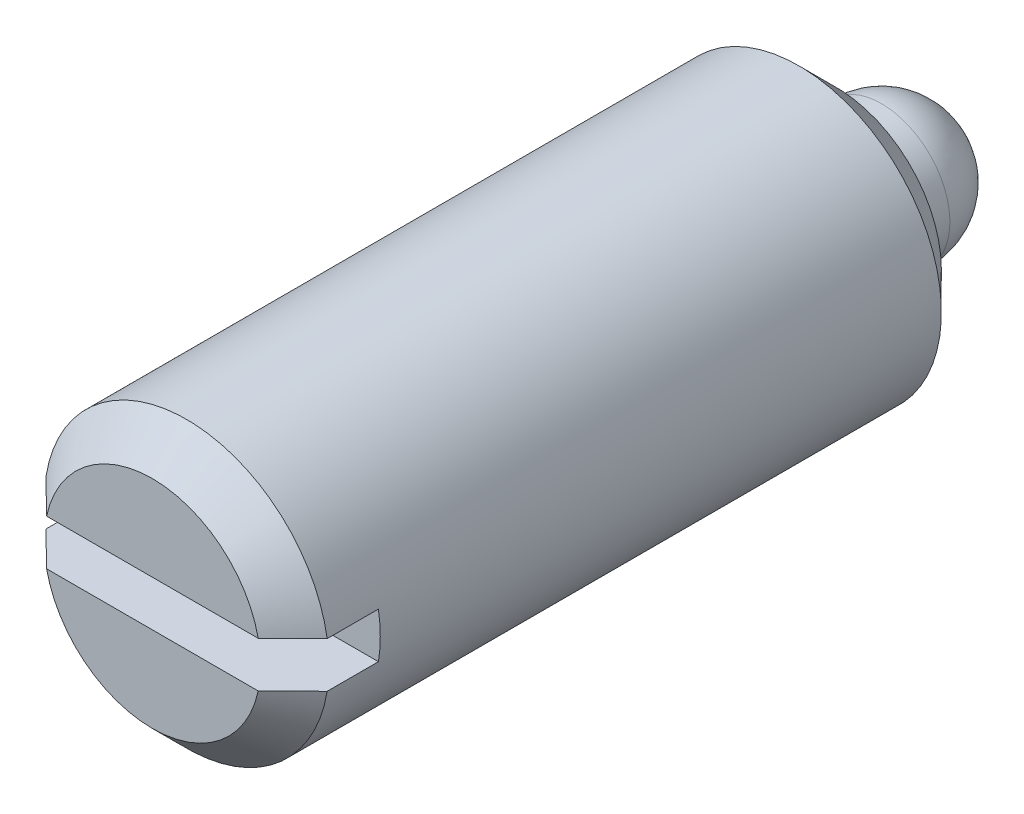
ISO-10303-21;
HEADER;
FILE_DESCRIPTION(('STEP AP214'),'2;1');
FILE_NAME('part.step','',(''),(''),'','','');
FILE_SCHEMA(('AUTOMOTIVE_DESIGN { 1 0 10303 214 1 1 1 1 }'));
ENDSEC;
DATA;
#1=APPLICATION_CONTEXT('core data for automotive mechanical design processes');
#2=APPLICATION_PROTOCOL_DEFINITION('international standard','automotive_design',2000,#1);
#3=PRODUCT_CONTEXT('',#1,'mechanical');
#4=PRODUCT('Part','Part','',(#3));
#5=PRODUCT_RELATED_PRODUCT_CATEGORY('part','',(#4));
#6=PRODUCT_DEFINITION_FORMATION('','',#4);
#7=PRODUCT_DEFINITION_CONTEXT('part definition',#1,'design');
#8=PRODUCT_DEFINITION('design','',#6,#7);
#9=PRODUCT_DEFINITION_SHAPE('','',#8);
#10=(LENGTH_UNIT() NAMED_UNIT(*) SI_UNIT(.MILLI.,.METRE.));
#11=(NAMED_UNIT(*) PLANE_ANGLE_UNIT() SI_UNIT($,.RADIAN.));
#12=(NAMED_UNIT(*) SI_UNIT($,.STERADIAN.) SOLID_ANGLE_UNIT());
#13=UNCERTAINTY_MEASURE_WITH_UNIT(LENGTH_MEASURE(1.E-05),#10,'distance_accuracy_value','');
#14=(GEOMETRIC_REPRESENTATION_CONTEXT(3) GLOBAL_UNCERTAINTY_ASSIGNED_CONTEXT((#13)) GLOBAL_UNIT_ASSIGNED_CONTEXT((#10,
#11,#12)) REPRESENTATION_CONTEXT('',''));
#15=CARTESIAN_POINT('',(0.,0.,0.));
#16=DIRECTION('',(0.,0.,1.));
#17=DIRECTION('',(1.,0.,0.));
#18=AXIS2_PLACEMENT_3D('',#15,#16,#17);
#19=CARTESIAN_POINT('',(0.,0.,1.2));
#20=DIRECTION('',(0.,0.,1.));
#21=DIRECTION('',(0.,-1.,0.));
#22=AXIS2_PLACEMENT_3D('',#19,#20,#21);
#23=SPHERICAL_SURFACE('',#22,1.2);
#24=CARTESIAN_POINT('',(0.,1.2E-08,0.));
#25=VERTEX_POINT('',#24);
#26=VERTEX_LOOP('',#25);
#27=FACE_BOUND('',#26,.T.);
#28=CARTESIAN_POINT('',(0.,0.,1.2));
#29=DIRECTION('',(0.,0.,1.));
#30=DIRECTION('',(-1.,0.,0.));
#31=AXIS2_PLACEMENT_3D('',#28,#29,#30);
#32=CIRCLE('',#31,1.2);
#33=CARTESIAN_POINT('',(-1.2,0.,1.2));
#34=VERTEX_POINT('',#33);
#35=EDGE_CURVE('E110',#34,#34,#32,.T.);
#36=ORIENTED_EDGE('',*,*,#35,.F.);
#37=EDGE_LOOP('',(#36));
#38=FACE_BOUND('',#37,.T.);
#39=ADVANCED_FACE('F14',(#27,#38),#23,.T.);
#40=CARTESIAN_POINT('',(0.,0.,1.2));
#41=DIRECTION('',(0.,0.,1.));
#42=DIRECTION('',(-1.,0.,0.));
#43=AXIS2_PLACEMENT_3D('',#40,#41,#42);
#44=CYLINDRICAL_SURFACE('',#43,1.2);
#45=CARTESIAN_POINT('',(0.,0.,2.));
#46=DIRECTION('',(0.,0.,1.));
#47=DIRECTION('',(-1.,0.,0.));
#48=AXIS2_PLACEMENT_3D('',#45,#46,#47);
#49=CIRCLE('',#48,1.2);
#50=CARTESIAN_POINT('',(-1.2,0.,2.));
#51=VERTEX_POINT('',#50);
#52=EDGE_CURVE('E113',#51,#51,#49,.F.);
#53=ORIENTED_EDGE('',*,*,#52,.T.);
#54=EDGE_LOOP('',(#53));
#55=FACE_BOUND('',#54,.T.);
#56=ORIENTED_EDGE('',*,*,#35,.T.);
#57=EDGE_LOOP('',(#56));
#58=FACE_BOUND('',#57,.T.);
#59=ADVANCED_FACE('F190',(#55,#58),#44,.T.);
#60=CARTESIAN_POINT('',(-1.463031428,1.519055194,14.));
#61=DIRECTION('',(0.,0.,-1.));
#62=DIRECTION('',(1.,0.,0.));
#63=AXIS2_PLACEMENT_3D('',#60,#61,#62);
#64=PLANE('',#63);
#65=DIRECTION('',(1.,0.,0.));
#66=VECTOR('',#65,1.);
#67=CARTESIAN_POINT('',(0.,0.4,14.));
#68=LINE('',#67,#66);
#69=CARTESIAN_POINT('',(-1.85741756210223,0.4,14.));
#70=VERTEX_POINT('',#69);
#71=CARTESIAN_POINT('',(1.85741756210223,0.4,14.));
#72=VERTEX_POINT('',#71);
#73=EDGE_CURVE('E117',#70,#72,#68,.T.);
#74=ORIENTED_EDGE('',*,*,#73,.T.);
#75=CARTESIAN_POINT('',(0.,0.,14.));
#76=DIRECTION('',(0.,0.,-1.));
#77=DIRECTION('',(0.,1.,0.));
#78=AXIS2_PLACEMENT_3D('',#75,#76,#77);
#79=CIRCLE('',#78,1.90000000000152);
#80=EDGE_CURVE('E120',#72,#70,#79,.F.);
#81=ORIENTED_EDGE('',*,*,#80,.T.);
#82=EDGE_LOOP('',(#74,#81));
#83=FACE_BOUND('',#82,.T.);
#84=ADVANCED_FACE('F164',(#83),#64,.F.);
#85=CARTESIAN_POINT('',(1.8722,1.878642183,2.));
#86=DIRECTION('',(0.,0.,1.));
#87=DIRECTION('',(-1.,0.,0.));
#88=AXIS2_PLACEMENT_3D('',#85,#86,#87);
#89=PLANE('',#88);
#90=ORIENTED_EDGE('',*,*,#52,.F.);
#91=EDGE_LOOP('',(#90));
#92=FACE_BOUND('',#91,.T.);
#93=CARTESIAN_POINT('',(0.,0.,2.));
#94=DIRECTION('',(0.,0.,1.));
#95=DIRECTION('',(-1.,0.,0.));
#96=AXIS2_PLACEMENT_3D('',#93,#94,#95);
#97=CIRCLE('',#96,1.85);
#98=CARTESIAN_POINT('',(-1.85,0.,2.));
#99=VERTEX_POINT('',#98);
#100=EDGE_CURVE('E114',#99,#99,#97,.T.);
#101=ORIENTED_EDGE('',*,*,#100,.F.);
#102=EDGE_LOOP('',(#101));
#103=FACE_BOUND('',#102,.T.);
#104=ADVANCED_FACE('F173',(#92,#103),#89,.F.);
#105=CARTESIAN_POINT('',(-1.463031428,-0.4,14.));
#106=DIRECTION('',(0.,0.,-1.));
#107=DIRECTION('',(1.,0.,0.));
#108=AXIS2_PLACEMENT_3D('',#105,#106,#107);
#109=PLANE('',#108);
#110=DIRECTION('',(-1.,0.,0.));
#111=VECTOR('',#110,1.);
#112=CARTESIAN_POINT('',(0.,-0.4,14.));
#113=LINE('',#112,#111);
#114=CARTESIAN_POINT('',(1.8574175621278,-0.4,14.));
#115=VERTEX_POINT('',#114);
#116=CARTESIAN_POINT('',(-1.8574175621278,-0.4,14.));
#117=VERTEX_POINT('',#116);
#118=EDGE_CURVE('E106',#115,#117,#113,.T.);
#119=ORIENTED_EDGE('',*,*,#118,.T.);
#120=CARTESIAN_POINT('',(0.,0.,14.));
#121=DIRECTION('',(0.,0.,-1.));
#122=DIRECTION('',(0.,1.,0.));
#123=AXIS2_PLACEMENT_3D('',#120,#121,#122);
#124=CIRCLE('',#123,1.90000000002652);
#125=EDGE_CURVE('E155',#117,#115,#124,.F.);
#126=ORIENTED_EDGE('',*,*,#125,.T.);
#127=EDGE_LOOP('',(#119,#126));
#128=FACE_BOUND('',#127,.T.);
#129=ADVANCED_FACE('F143',(#128),#109,.F.);
#130=CARTESIAN_POINT('',(-2.467792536,0.4,14.));
#131=DIRECTION('',(0.,1.,0.));
#132=DIRECTION('',(1.,0.,0.));
#133=AXIS2_PLACEMENT_3D('',#130,#131,#132);
#134=PLANE('',#133);
#135=DIRECTION('',(0.,0.,1.));
#136=VECTOR('',#135,1.);
#137=CARTESIAN_POINT('',(-2.46779253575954,0.400000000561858,7.825));
#138=LINE('',#137,#136);
#139=CARTESIAN_POINT('',(-2.46779253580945,0.400000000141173,12.5));
#140=VERTEX_POINT('',#139);
#141=CARTESIAN_POINT('',(-2.46779253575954,0.400000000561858,13.4000000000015));
#142=VERTEX_POINT('',#141);
#143=EDGE_CURVE('E94',#140,#142,#138,.T.);
#144=ORIENTED_EDGE('',*,*,#143,.F.);
#145=DIRECTION('',(-1.,-3.01401580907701E-11,0.));
#146=VECTOR('',#145,1.);
#147=CARTESIAN_POINT('',(2.46779253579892,0.400000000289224,12.5));
#148=LINE('',#147,#146);
#149=CARTESIAN_POINT('',(2.46779253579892,0.400000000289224,12.5));
#150=VERTEX_POINT('',#149);
#151=EDGE_CURVE('E79',#150,#140,#148,.T.);
#152=ORIENTED_EDGE('',*,*,#151,.F.);
#153=DIRECTION('',(0.,0.,-1.));
#154=VECTOR('',#153,1.);
#155=CARTESIAN_POINT('',(2.4677925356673,0.400000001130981,7.825));
#156=LINE('',#155,#154);
#157=CARTESIAN_POINT('',(2.4677925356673,0.400000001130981,13.4000000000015));
#158=VERTEX_POINT('',#157);
#159=EDGE_CURVE('E91',#158,#150,#156,.T.);
#160=ORIENTED_EDGE('',*,*,#159,.F.);
#161=CARTESIAN_POINT('',(2.4677925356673,0.400000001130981,13.4000000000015));
#162=CARTESIAN_POINT('',(2.41703205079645,0.400000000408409,13.4501058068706));
#163=CARTESIAN_POINT('',(2.36625249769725,0.400000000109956,13.5001923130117));
#164=CARTESIAN_POINT('',(2.26464552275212,0.399999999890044,13.6003166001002));
#165=CARTESIAN_POINT('',(2.21381810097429,0.399999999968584,13.6503543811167));
#166=CARTESIAN_POINT('',(2.11210548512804,0.400000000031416,13.7503712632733));
#167=CARTESIAN_POINT('',(2.0612202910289,0.400000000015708,13.8003503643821));
#168=CARTESIAN_POINT('',(1.95937717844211,0.399999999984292,13.9002345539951));
#169=CARTESIAN_POINT('',(1.90841925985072,0.399999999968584,13.9501396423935));
#170=CARTESIAN_POINT('',(1.85741756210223,0.4,14.));
#171=B_SPLINE_CURVE_WITH_KNOTS('',3,(#161,#162,#163,#164,#165,#166,#167,#168,#169,#170),
.UNSPECIFIED.,.F.,.F.,(4,2,2,2,4),(0.,0.213974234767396,0.427948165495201,0.641922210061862,
0.855896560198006),.UNSPECIFIED.);
#172=EDGE_CURVE('E123',#158,#72,#171,.T.);
#173=ORIENTED_EDGE('',*,*,#172,.T.);
#174=ORIENTED_EDGE('',*,*,#73,.F.);
#175=CARTESIAN_POINT('',(-1.85741756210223,0.4,14.));
#176=CARTESIAN_POINT('',(-1.90841925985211,0.4,13.9501396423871));
#177=CARTESIAN_POINT('',(-1.95937717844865,0.4,13.9002345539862));
#178=CARTESIAN_POINT('',(-2.06122029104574,0.4,13.8003503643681));
#179=CARTESIAN_POINT('',(-2.11210548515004,0.4,13.7503712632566));
#180=CARTESIAN_POINT('',(-2.21381810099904,0.4,13.6503543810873));
#181=CARTESIAN_POINT('',(-2.26464552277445,0.4,13.6003166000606));
#182=CARTESIAN_POINT('',(-2.3662524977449,0.4,13.5001923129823));
#183=CARTESIAN_POINT('',(-2.41703205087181,0.4,13.4501058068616));
#184=CARTESIAN_POINT('',(-2.46779253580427,0.4,13.4000000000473));
#185=B_SPLINE_CURVE_WITH_KNOTS('',3,(#175,#176,#177,#178,#179,#180,#181,#182,#183,#184),
.UNSPECIFIED.,.F.,.F.,(4,2,2,2,4),(0.,0.213974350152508,0.427948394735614,0.641922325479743,
0.855896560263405),.UNSPECIFIED.);
#186=EDGE_CURVE('E131',#70,#142,#185,.T.);
#187=ORIENTED_EDGE('',*,*,#186,.T.);
#188=EDGE_LOOP('',(#144,#152,#160,#173,#174,#187));
#189=FACE_BOUND('',#188,.T.);
#190=ADVANCED_FACE('F90',(#189),#134,.F.);
#191=CARTESIAN_POINT('',(0.,0.,2.));
#192=DIRECTION('',(0.,0.,1.));
#193=DIRECTION('',(-1.,0.,0.));
#194=AXIS2_PLACEMENT_3D('',#191,#192,#193);
#195=CONICAL_SURFACE('',#194,1.85,0.785398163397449);
#196=CARTESIAN_POINT('',(0.,0.,2.65));
#197=DIRECTION('',(0.,0.,1.));
#198=DIRECTION('',(-1.,0.,0.));
#199=AXIS2_PLACEMENT_3D('',#196,#197,#198);
#200=CIRCLE('',#199,2.5);
#201=CARTESIAN_POINT('',(-2.5,0.,2.65));
#202=VERTEX_POINT('',#201);
#203=EDGE_CURVE('E101',#202,#202,#200,.T.);
#204=ORIENTED_EDGE('',*,*,#203,.F.);
#205=EDGE_LOOP('',(#204));
#206=FACE_BOUND('',#205,.T.);
#207=ORIENTED_EDGE('',*,*,#100,.T.);
#208=EDGE_LOOP('',(#207));
#209=FACE_BOUND('',#208,.T.);
#210=ADVANCED_FACE('F142',(#206,#209),#195,.T.);
#211=CARTESIAN_POINT('',(2.467792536,-0.4,14.));
#212=DIRECTION('',(0.,-1.,0.));
#213=DIRECTION('',(-1.,0.,0.));
#214=AXIS2_PLACEMENT_3D('',#211,#212,#213);
#215=PLANE('',#214);
#216=DIRECTION('',(0.,0.,1.));
#217=VECTOR('',#216,1.);
#218=CARTESIAN_POINT('',(2.46779253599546,-0.39999999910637,7.825));
#219=LINE('',#218,#217);
#220=CARTESIAN_POINT('',(2.46779253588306,-0.399999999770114,12.5));
#221=VERTEX_POINT('',#220);
#222=CARTESIAN_POINT('',(2.46779253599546,-0.39999999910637,13.4000000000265));
#223=VERTEX_POINT('',#222);
#224=EDGE_CURVE('E104',#221,#223,#219,.T.);
#225=ORIENTED_EDGE('',*,*,#224,.F.);
#226=DIRECTION('',(1.,5.23009519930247E-11,0.));
#227=VECTOR('',#226,1.);
#228=CARTESIAN_POINT('',(-2.46779253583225,-0.40000000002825,12.5));
#229=LINE('',#228,#227);
#230=CARTESIAN_POINT('',(-2.46779253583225,-0.40000000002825,12.5));
#231=VERTEX_POINT('',#230);
#232=EDGE_CURVE('E82',#231,#221,#229,.T.);
#233=ORIENTED_EDGE('',*,*,#232,.F.);
#234=DIRECTION('',(0.,0.,-1.));
#235=VECTOR('',#234,1.);
#236=CARTESIAN_POINT('',(-2.46779253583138,-0.400000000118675,7.825));
#237=LINE('',#236,#235);
#238=CARTESIAN_POINT('',(-2.46779253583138,-0.400000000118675,13.4000000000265));
#239=VERTEX_POINT('',#238);
#240=EDGE_CURVE('E124',#239,#231,#237,.T.);
#241=ORIENTED_EDGE('',*,*,#240,.F.);
#242=CARTESIAN_POINT('',(-2.46779253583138,-0.400000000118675,13.4000000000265));
#243=CARTESIAN_POINT('',(-2.41703205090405,-0.400000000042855,13.4501058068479));
#244=CARTESIAN_POINT('',(-2.36625249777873,-0.400000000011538,13.5001923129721));
#245=CARTESIAN_POINT('',(-2.26464552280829,-0.399999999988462,13.6003166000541));
#246=CARTESIAN_POINT('',(-2.21381810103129,-0.399999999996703,13.6503543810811));
#247=CARTESIAN_POINT('',(-2.11210548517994,-0.400000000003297,13.7503712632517));
#248=CARTESIAN_POINT('',(-2.06122029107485,-0.400000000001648,13.8003503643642));
#249=CARTESIAN_POINT('',(-1.95937717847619,-0.399999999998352,13.9002345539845));
#250=CARTESIAN_POINT('',(-1.90841925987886,-0.399999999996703,13.9501396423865));
#251=CARTESIAN_POINT('',(-1.8574175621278,-0.4,14.));
#252=B_SPLINE_CURVE_WITH_KNOTS('',3,(#242,#243,#244,#245,#246,#247,#248,#249,#250,#251),
.UNSPECIFIED.,.F.,.F.,(4,2,2,2,4),(0.,0.213974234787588,0.427948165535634,0.641922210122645,
0.855896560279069),.UNSPECIFIED.);
#253=EDGE_CURVE('E28',#239,#117,#252,.T.);
#254=ORIENTED_EDGE('',*,*,#253,.T.);
#255=ORIENTED_EDGE('',*,*,#118,.F.);
#256=CARTESIAN_POINT('',(1.8574175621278,-0.4,14.));
#257=CARTESIAN_POINT('',(1.90841925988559,-0.4,13.9501396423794));
#258=CARTESIAN_POINT('',(1.95937717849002,-0.4,13.9002345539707));
#259=CARTESIAN_POINT('',(2.06122029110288,-0.4,13.800350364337));
#260=CARTESIAN_POINT('',(2.11210548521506,-0.4,13.7503712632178));
#261=CARTESIAN_POINT('',(2.2138181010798,-0.4,13.6503543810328));
#262=CARTESIAN_POINT('',(2.26464552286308,-0.4,13.6003165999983));
#263=CARTESIAN_POINT('',(2.36625249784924,-0.4,13.5001923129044));
#264=CARTESIAN_POINT('',(2.41703205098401,-0.4,13.4501058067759));
#265=CARTESIAN_POINT('',(2.46779253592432,-0.4,13.3999999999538));
#266=B_SPLINE_CURVE_WITH_KNOTS('',3,(#256,#257,#258,#259,#260,#261,#262,#263,#264,#265),
.UNSPECIFIED.,.F.,.F.,(4,2,2,2,4),(0.,0.213974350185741,0.42794839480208,0.64192232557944,
0.855896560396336),.UNSPECIFIED.);
#267=EDGE_CURVE('E9',#115,#223,#266,.T.);
#268=ORIENTED_EDGE('',*,*,#267,.T.);
#269=EDGE_LOOP('',(#225,#233,#241,#254,#255,#268));
#270=FACE_BOUND('',#269,.T.);
#271=ADVANCED_FACE('F145',(#270),#215,.F.);
#272=CARTESIAN_POINT('',(0.,0.,2.65));
#273=DIRECTION('',(0.,0.,1.));
#274=DIRECTION('',(-1.,0.,0.));
#275=AXIS2_PLACEMENT_3D('',#272,#273,#274);
#276=CYLINDRICAL_SURFACE('',#275,2.5);
#277=CARTESIAN_POINT('',(0.,0.,12.5));
#278=DIRECTION('',(0.,0.,1.));
#279=DIRECTION('',(0.,-1.,0.));
#280=AXIS2_PLACEMENT_3D('',#277,#278,#279);
#281=CIRCLE('',#280,2.49999999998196);
#282=EDGE_CURVE('E95',#140,#231,#281,.T.);
#283=ORIENTED_EDGE('',*,*,#282,.F.);
#284=ORIENTED_EDGE('',*,*,#143,.T.);
#285=CARTESIAN_POINT('',(0.,0.,13.4000000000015));
#286=DIRECTION('',(0.,0.,-1.));
#287=DIRECTION('',(0.,1.,0.));
#288=AXIS2_PLACEMENT_3D('',#285,#286,#287);
#289=CIRCLE('',#288,2.5);
#290=EDGE_CURVE('E100',#142,#158,#289,.T.);
#291=ORIENTED_EDGE('',*,*,#290,.T.);
#292=ORIENTED_EDGE('',*,*,#159,.T.);
#293=CARTESIAN_POINT('',(0.,0.,12.5));
#294=DIRECTION('',(0.,0.,1.));
#295=DIRECTION('',(0.,-1.,0.));
#296=AXIS2_PLACEMENT_3D('',#293,#294,#295);
#297=CIRCLE('',#296,2.49999999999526);
#298=EDGE_CURVE('E76',#221,#150,#297,.T.);
#299=ORIENTED_EDGE('',*,*,#298,.F.);
#300=ORIENTED_EDGE('',*,*,#224,.T.);
#301=CARTESIAN_POINT('',(0.,0.,13.4000000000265));
#302=DIRECTION('',(0.,0.,-1.));
#303=DIRECTION('',(0.,1.,0.));
#304=AXIS2_PLACEMENT_3D('',#301,#302,#303);
#305=CIRCLE('',#304,2.5);
#306=EDGE_CURVE('E157',#223,#239,#305,.T.);
#307=ORIENTED_EDGE('',*,*,#306,.T.);
#308=ORIENTED_EDGE('',*,*,#240,.T.);
#309=EDGE_LOOP('',(#283,#284,#291,#292,#299,#300,#307,#308));
#310=FACE_BOUND('',#309,.T.);
#311=ORIENTED_EDGE('',*,*,#203,.T.);
#312=EDGE_LOOP('',(#311));
#313=FACE_BOUND('',#312,.T.);
#314=ADVANCED_FACE('F97',(#310,#313),#276,.T.);
#315=CARTESIAN_POINT('',(0.,0.,14.));
#316=DIRECTION('',(0.,0.,-1.));
#317=DIRECTION('',(0.,1.,0.));
#318=AXIS2_PLACEMENT_3D('',#315,#316,#317);
#319=CONICAL_SURFACE('',#318,1.90000000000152,0.785398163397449);
#320=ORIENTED_EDGE('',*,*,#172,.F.);
#321=ORIENTED_EDGE('',*,*,#290,.F.);
#322=ORIENTED_EDGE('',*,*,#186,.F.);
#323=ORIENTED_EDGE('',*,*,#80,.F.);
#324=EDGE_LOOP('',(#320,#321,#322,#323));
#325=FACE_BOUND('',#324,.T.);
#326=ADVANCED_FACE('F137',(#325),#319,.T.);
#327=CARTESIAN_POINT('',(0.,0.,14.));
#328=DIRECTION('',(0.,0.,-1.));
#329=DIRECTION('',(0.,1.,0.));
#330=AXIS2_PLACEMENT_3D('',#327,#328,#329);
#331=CONICAL_SURFACE('',#330,1.90000000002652,0.785398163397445);
#332=ORIENTED_EDGE('',*,*,#253,.F.);
#333=ORIENTED_EDGE('',*,*,#306,.F.);
#334=ORIENTED_EDGE('',*,*,#267,.F.);
#335=ORIENTED_EDGE('',*,*,#125,.F.);
#336=EDGE_LOOP('',(#332,#333,#334,#335));
#337=FACE_BOUND('',#336,.T.);
#338=ADVANCED_FACE('F16',(#337),#331,.T.);
#339=CARTESIAN_POINT('',(0.,0.,12.5));
#340=DIRECTION('',(0.,0.,1.));
#341=DIRECTION('',(0.,-1.,0.));
#342=AXIS2_PLACEMENT_3D('',#339,#340,#341);
#343=PLANE('',#342);
#344=ORIENTED_EDGE('',*,*,#298,.T.);
#345=ORIENTED_EDGE('',*,*,#151,.T.);
#346=ORIENTED_EDGE('',*,*,#282,.T.);
#347=ORIENTED_EDGE('',*,*,#232,.T.);
#348=EDGE_LOOP('',(#344,#345,#346,#347));
#349=FACE_BOUND('',#348,.T.);
#350=ADVANCED_FACE('F78',(#349),#343,.T.);
#351=CLOSED_SHELL('',(#39,#59,#84,#104,#129,#190,#210,#271,#314,#326,#338,#350));
#352=MANIFOLD_SOLID_BREP('B1',#351);
#353=ADVANCED_BREP_SHAPE_REPRESENTATION('',(#18,#352),#14);
#354=SHAPE_DEFINITION_REPRESENTATION(#9,#353);
ENDSEC;
END-ISO-10303-21;
